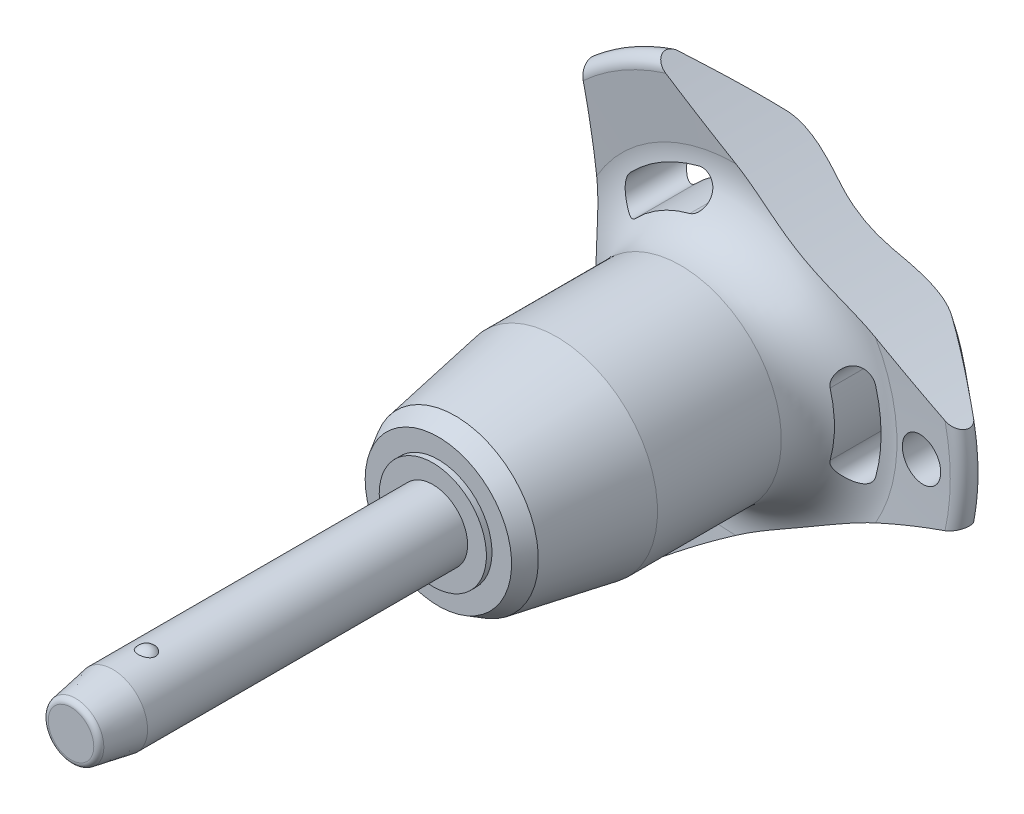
from build123d import *

# Parameters (mm, degrees)
SKETCH1_R           = 2.5
BOSS_EXTRUDE1_DEPTH = 20
SKETCH2_R           = 2.1
BOSS_EXTRUDE2_DEPTH = 26.7
BOSS_EXTRUDE3_START = 6
SKETCH1_2_R         = 2.5
BOSS_EXTRUDE3_DEPTH = 6
CHAMFER1_SIZE       = 3
CHAMFER1_SIZE2      = 0.528980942
FILLET1_R           = 0.4
SKETCH6_R           = 79.96
CUT_EXTRUDE1_DEPTH  = 53.269297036
CIRPATTERN1_COUNT   = 3
SKETCH7_R           = 1.5
CUT_EXTRUDE2_DEPTH  = 52.977278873


with BuildPart() as part:
    # Sketch1 → Boss-Extrude1 (new body)
    with BuildSketch(Plane.XY):
        Circle(SKETCH1_R)
    extrude(amount=-BOSS_EXTRUDE1_DEPTH)

    # Sketch2 → Boss-Extrude2 (add)
    with BuildSketch(Plane(origin=(0, 0, -20), x_dir=(-1, 0, 0), z_dir=(0, 0, -1))):
        Circle(SKETCH2_R)
    extrude(amount=BOSS_EXTRUDE2_DEPTH)

    # Sketch3 → Revolve1 (revolve)
    with BuildSketch(Plane(origin=(0, 0, 0), x_dir=(0, 0, -1), z_dir=(1, 0, 0))):
        with BuildLine():
            Line((-0.580947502, 2.75), (-0.580947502, 1.15))
            ThreePointArc((-0.580947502, 1.15), (0.219052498, 1.95), (-0.580947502, 2.75))
        make_face()
        with BuildLine():
            Line((-0.580947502, -1.15), (-0.580947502, -2.75))
            ThreePointArc((-0.580947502, -2.75), (0.219052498, -1.95), (-0.580947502, -1.15))
        make_face()
    revolve(axis=Axis((0, -1.15, 0.580947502), (0, 1, 0)))

    # Sketch1_2 → Boss-Extrude3 (add)
    with BuildSketch(Plane.XY.offset(BOSS_EXTRUDE3_START)):
        Circle(SKETCH1_2_R)
    extrude(amount=-BOSS_EXTRUDE3_DEPTH)

    # Chamfer1
    chamfer1_edges = [part.edges().sort_by_distance(p)[0] for p in [
        (-2.5, 0, 6),
    ]]
    chamfer1_side = [part.faces().sort_by_distance(p)[0] for p in [
        (-2.5, 0, -7),
    ]]
    chamfer(chamfer1_edges, length=CHAMFER1_SIZE, length2=CHAMFER1_SIZE2, reference=chamfer1_side[0])

    # Fillet1
    fillet1_edges = [part.edges().sort_by_distance(p)[0] for p in [
        (-1.971019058, 0, 6),
        (2.1, 0, -46.7),
    ]]
    fillet(fillet1_edges, radius=FILLET1_R)

    # Sketch4 → Revolve2 (revolve)
    with BuildSketch(Plane(origin=(0, 0, 0), x_dir=(0, 0, -1), z_dir=(1, 0, 0)), mode=Mode.PRIVATE) as revolve2_sk:
        Polygon((20, 0), (20, 3.851837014), (20.4, 3.851837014), (20.4, 5.26161122), (21.620900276, 5.966498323), (28.9, 7.25), (37.8, 7.25), (37.8, 0), align=None)
    revolve(revolve2_sk.sketch.rotate(Axis((0, 0, -37.8), (0, 0, 1)), 90), axis=Axis((0, 0, -37.8), (0, 0, 1)))

    # Sketch5 → Revolve3 (revolve)
    with BuildSketch(Plane(origin=(0, 0, 0), x_dir=(0, 0, -1), z_dir=(1, 0, 0)), mode=Mode.PRIVATE) as revolve3_sk:
        with BuildLine():
            Line((41.78715932, 11.570250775), (41.452568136, 15.735949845))
            ThreePointArc((41.452568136, 15.735949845), (41.946485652, 16.540188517), (42.862835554, 16.314230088))
            Line((42.862835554, 16.314230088), (46.326414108, 12.186497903))
            ThreePointArc((46.326414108, 12.186497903), (46.7, 11.109282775), (46.261488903, 10.056825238))
            ThreePointArc((46.261488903, 10.056825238), (43.289873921, 5.413681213), (42.25, 0))
            Line((42.25, 0), (37.8, 0))
            Line((37.8, 0), (37.8, 7.25))
            ThreePointArc((37.8, 7.25), (40.739473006, 8.537160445), (41.78715932, 11.570250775))
        make_face()
    revolve(revolve3_sk.sketch.rotate(Axis((0, 0, -42.25), (0, 0, 1)), 90), axis=Axis((0, 0, -42.25), (0, 0, 1)))

    # Sketch6 → Cut-Extrude1 (cut, through all)
    with BuildSketch(Plane.XY):
        with Locations((-89.76, 0)):
            Circle(SKETCH6_R)
        with BuildLine():
            ThreePointArc((10.099921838, -2.834717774), (10.490188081, 0), (10.099921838, 2.834717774))
            ThreePointArc((10.099921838, 2.834717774), (8.768180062, 3.582738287), (8.020159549, 2.250996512))
            ThreePointArc((8.020159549, 2.250996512), (8.330062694, 0), (8.020159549, -2.250996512))
            ThreePointArc((8.020159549, -2.250996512), (8.768180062, -3.582738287), (10.099921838, -2.834717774))
        make_face()
    cut_extrude1 = extrude(amount=-CUT_EXTRUDE1_DEPTH, mode=Mode.SUBTRACT)

    # CirPattern1: Cut-Extrude1 ×3 about axis
    cirpattern1_axis = Axis((0, 0, 0), (0, 0, 1))
    for i in range(1, CIRPATTERN1_COUNT):
        add(cut_extrude1.rotate(cirpattern1_axis, i * 360 / CIRPATTERN1_COUNT), mode=Mode.SUBTRACT)

    # Sketch7 → Cut-Extrude2 (cut, through all)
    with BuildSketch(Plane.XY):
        with Locations(Location((13.490188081, 0, 0), (0, 0, 225.221865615))):
            Circle(SKETCH7_R)
    extrude(amount=-CUT_EXTRUDE2_DEPTH, mode=Mode.SUBTRACT)


solid = part.part
